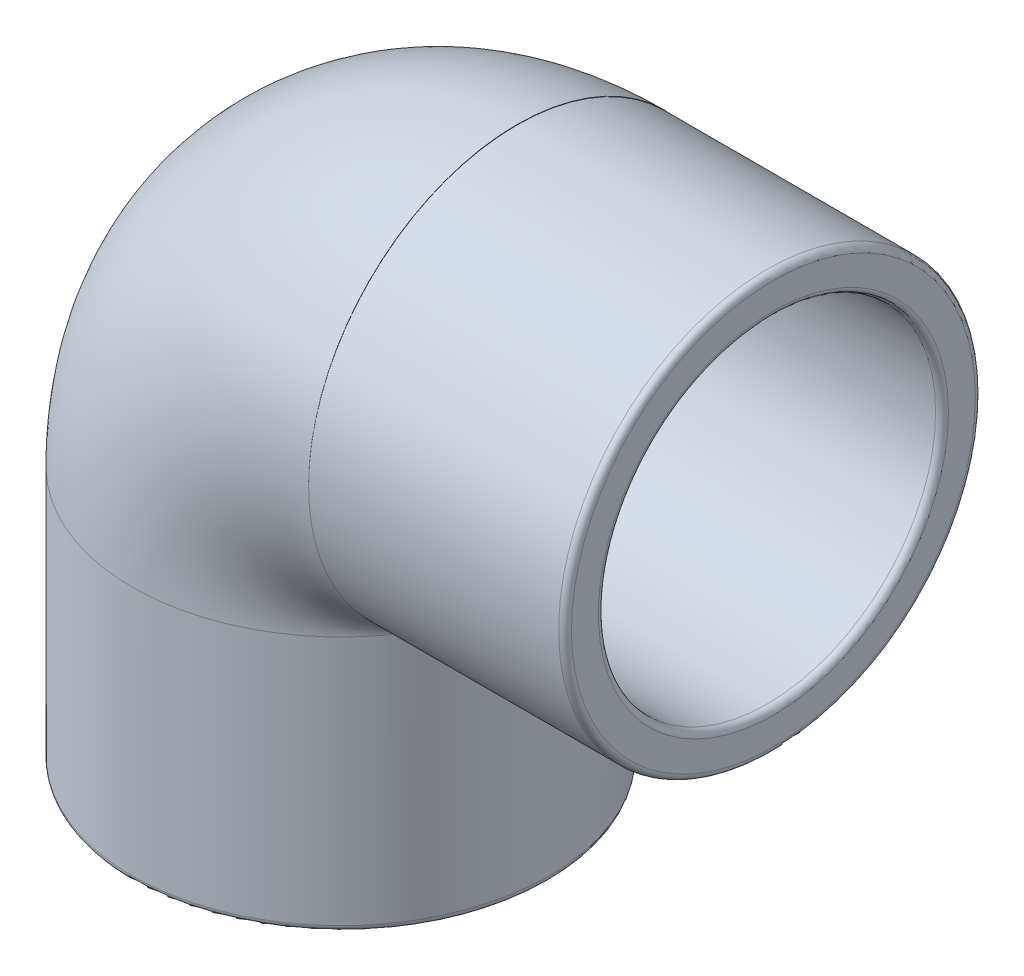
from build123d import *

# Parameters (mm, degrees)
SKETCH2_R           = 20.6375
SKETCH2_R_2         = 16.0655
BOSS_EXTRUDE1_DEPTH = 25.4
SKETCH10_R          = 20.6375
SKETCH10_R_2        = 16.0655
BOSS_EXTRUDE2_DEPTH = 25.4
SKETCH13_R          = 16.0655
REVOLVE1_ANGLE      = 90
SKETCH14_R          = 16.7005
CUT_EXTRUDE1_DEPTH  = 25.4
SKETCH15_R          = 16.7005
CUT_EXTRUDE2_DEPTH  = 25.4
FILLET1_R           = 0.635


with BuildPart() as part:
    # Sketch2 → Boss-Extrude1 (new body)
    with BuildSketch(Plane(origin=(25.4, 17.4625, 0), x_dir=(0, 0, -1), z_dir=(1, 0, 0))):
        with Locations((0, -0.037033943)):
            Circle(SKETCH2_R)
        with Locations((0, -0.037033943)):
            Circle(SKETCH2_R_2, mode=Mode.SUBTRACT)
    extrude(amount=-BOSS_EXTRUDE1_DEPTH)

    # Sketch10 → Boss-Extrude2 (add)
    with BuildSketch(Plane(origin=(-17.4625, -25.4, 0), x_dir=(-1, 0, 0), z_dir=(0, -1, 0))):
        with Locations(Location((0.001001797, 0, 0), (0, 0, 180))):
            Circle(SKETCH10_R)
        with Locations(Location((0.001001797, 0, 0), (0, 0, 180))):
            Circle(SKETCH10_R_2, mode=Mode.SUBTRACT)
    extrude(amount=-BOSS_EXTRUDE2_DEPTH)

    # Sketch13 → Revolve1 (revolve)
    with BuildSketch(Plane(origin=(0, 0, 0), x_dir=(1, 0, 0), z_dir=(0, 1, 0))):
        with BuildLine():
            Line((0, -10.996931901), (0, 10.996931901))
            ThreePointArc((0, 10.996931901), (-38.101001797, 0), (0, -10.996931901))
        make_face()
        with Locations((-17.463501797, 0)):
            Circle(SKETCH13_R, mode=Mode.SUBTRACT)
    revolve(axis=Axis((0, 0, -10.996931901), (0, 0, -1)), revolution_arc=REVOLVE1_ANGLE)

    # Sketch14 → Cut-Extrude1 (cut)
    with BuildSketch(Plane(origin=(25.4, 17.4625, 0), x_dir=(0, 0, -1), z_dir=(1, 0, 0))):
        with Locations((0, 0.001001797)):
            Circle(SKETCH14_R)
    extrude(amount=-CUT_EXTRUDE1_DEPTH, mode=Mode.SUBTRACT)

    # Sketch15 → Cut-Extrude2 (cut)
    with BuildSketch(Plane(origin=(-17.4625, -25.4, 0), x_dir=(-1, 0, 0), z_dir=(0, -1, 0))):
        with Locations(Location((0.001001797, 0, 0), (0, 0, 180))):
            Circle(SKETCH15_R)
    extrude(amount=-CUT_EXTRUDE2_DEPTH, mode=Mode.SUBTRACT)

    # Fillet1
    fillet1_edges = [part.edges().sort_by_distance(p)[0] for p in [
        (-38.101001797, -25.4, 0),
        (25.4, 17.425466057, 20.6375),
        (25.4, 17.463501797, 16.7005),
        (-34.164001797, -25.4, 0),
    ]]
    fillet(fillet1_edges, radius=FILLET1_R)


solid = part.part
